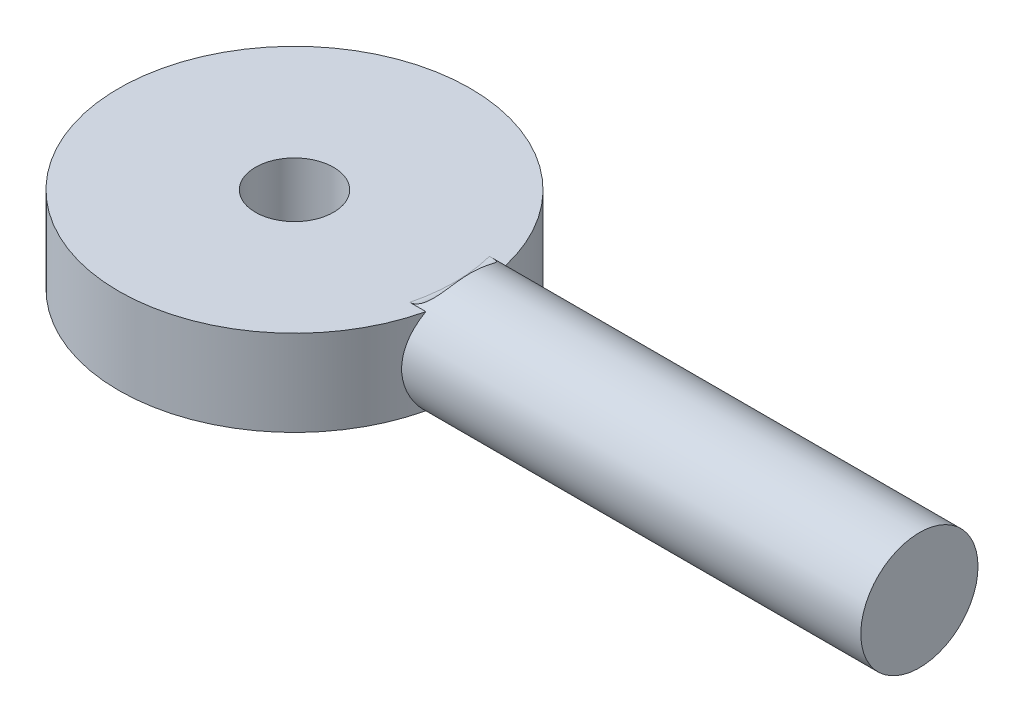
ISO-10303-21;
HEADER;
FILE_DESCRIPTION(('STEP AP214'),'2;1');
FILE_NAME('part.step','',(''),(''),'','','');
FILE_SCHEMA(('AUTOMOTIVE_DESIGN { 1 0 10303 214 1 1 1 1 }'));
ENDSEC;
DATA;
#1=APPLICATION_CONTEXT('core data for automotive mechanical design processes');
#2=APPLICATION_PROTOCOL_DEFINITION('international standard','automotive_design',2000,#1);
#3=PRODUCT_CONTEXT('',#1,'mechanical');
#4=PRODUCT('Part','Part','',(#3));
#5=PRODUCT_RELATED_PRODUCT_CATEGORY('part','',(#4));
#6=PRODUCT_DEFINITION_FORMATION('','',#4);
#7=PRODUCT_DEFINITION_CONTEXT('part definition',#1,'design');
#8=PRODUCT_DEFINITION('design','',#6,#7);
#9=PRODUCT_DEFINITION_SHAPE('','',#8);
#10=(LENGTH_UNIT() NAMED_UNIT(*) SI_UNIT(.MILLI.,.METRE.));
#11=(NAMED_UNIT(*) PLANE_ANGLE_UNIT() SI_UNIT($,.RADIAN.));
#12=(NAMED_UNIT(*) SI_UNIT($,.STERADIAN.) SOLID_ANGLE_UNIT());
#13=UNCERTAINTY_MEASURE_WITH_UNIT(LENGTH_MEASURE(1.E-05),#10,'distance_accuracy_value','');
#14=(GEOMETRIC_REPRESENTATION_CONTEXT(3) GLOBAL_UNCERTAINTY_ASSIGNED_CONTEXT((#13)) GLOBAL_UNIT_ASSIGNED_CONTEXT((#10,
#11,#12)) REPRESENTATION_CONTEXT('',''));
#15=CARTESIAN_POINT('',(0.,0.,0.));
#16=DIRECTION('',(0.,0.,1.));
#17=DIRECTION('',(1.,0.,0.));
#18=AXIS2_PLACEMENT_3D('',#15,#16,#17);
#19=CARTESIAN_POINT('',(-9.99200722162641E-13,3.49250000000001,-2.22044604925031E-13));
#20=DIRECTION('',(0.,-1.,0.));
#21=DIRECTION('',(0.,0.,-1.));
#22=AXIS2_PLACEMENT_3D('',#19,#20,#21);
#23=CYLINDRICAL_SURFACE('',#22,14.2875);
#24=CARTESIAN_POINT('',(-9.99200722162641E-13,3.49250000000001,-2.22044604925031E-13));
#25=DIRECTION('',(0.,1.,0.));
#26=DIRECTION('',(0.,0.,1.));
#27=AXIS2_PLACEMENT_3D('',#24,#25,#26);
#28=CIRCLE('',#27,14.2875);
#29=CARTESIAN_POINT('',(13.915775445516,3.49249999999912,-3.23787739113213));
#30=VERTEX_POINT('',#29);
#31=CARTESIAN_POINT('',(13.9157754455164,3.4924999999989,3.2378773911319));
#32=VERTEX_POINT('',#31);
#33=EDGE_CURVE('E105',#30,#32,#28,.T.);
#34=ORIENTED_EDGE('',*,*,#33,.F.);
#35=CARTESIAN_POINT('',(13.4703841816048,-8.88178419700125E-13,-4.76249999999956));
#36=CARTESIAN_POINT('',(13.470383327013,0.25940468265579,-4.76250122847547));
#37=CARTESIAN_POINT('',(13.4779592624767,0.518801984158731,-4.74123440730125));
#38=CARTESIAN_POINT('',(13.5072869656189,1.02991167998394,-4.65701601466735));
#39=CARTESIAN_POINT('',(13.529041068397,1.28162280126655,-4.59405757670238));
#40=CARTESIAN_POINT('',(13.5839932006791,1.76987307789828,-4.42891300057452));
#41=CARTESIAN_POINT('',(13.6171687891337,2.00644091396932,-4.32680374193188));
#42=CARTESIAN_POINT('',(13.691193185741,2.45916473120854,-4.08651850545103));
#43=CARTESIAN_POINT('',(13.7320436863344,2.67531619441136,-3.94833456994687));
#44=CARTESIAN_POINT('',(13.8186075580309,3.08952882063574,-3.63403108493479));
#45=CARTESIAN_POINT('',(13.8644421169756,3.28667472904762,-3.45673842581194));
#46=CARTESIAN_POINT('',(13.9547853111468,3.64905989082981,-3.07175376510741));
#47=CARTESIAN_POINT('',(13.9992937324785,3.81429402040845,-2.86405689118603));
#48=CARTESIAN_POINT('',(14.0833729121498,4.11231824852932,-2.41746646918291));
#49=CARTESIAN_POINT('',(14.1227845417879,4.24414936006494,-2.17790035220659));
#50=CARTESIAN_POINT('',(14.1908015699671,4.46527992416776,-1.67845369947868));
#51=CARTESIAN_POINT('',(14.2194098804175,4.55459083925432,-1.41857866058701));
#52=CARTESIAN_POINT('',(14.2617384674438,4.68504200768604,-0.89548724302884));
#53=CARTESIAN_POINT('',(14.2759421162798,4.72775016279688,-0.632701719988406));
#54=CARTESIAN_POINT('',(14.2895768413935,4.76876884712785,-0.103336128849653));
#55=CARTESIAN_POINT('',(14.2890117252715,4.76709081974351,0.163242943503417));
#56=CARTESIAN_POINT('',(14.2735001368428,4.72037923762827,0.681530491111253));
#57=CARTESIAN_POINT('',(14.2591185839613,4.67704870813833,0.933412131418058));
#58=CARTESIAN_POINT('',(14.2182993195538,4.55107842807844,1.42609937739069));
#59=CARTESIAN_POINT('',(14.1918607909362,4.4684360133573,1.66690423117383));
#60=CARTESIAN_POINT('',(14.129178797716,4.26519347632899,2.13432616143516));
#61=CARTESIAN_POINT('',(14.0928110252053,4.14410871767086,2.36071515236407));
#62=CARTESIAN_POINT('',(14.0140559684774,3.86781815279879,2.79046460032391));
#63=CARTESIAN_POINT('',(13.9716670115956,3.71260285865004,2.99381863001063));
#64=CARTESIAN_POINT('',(13.8829823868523,3.36387570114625,3.38185537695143));
#65=CARTESIAN_POINT('',(13.8365967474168,3.16890483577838,3.56520824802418));
#66=CARTESIAN_POINT('',(13.7468293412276,2.75058794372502,3.89704544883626));
#67=CARTESIAN_POINT('',(13.7034480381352,2.52723755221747,4.04552440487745));
#68=CARTESIAN_POINT('',(13.6241087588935,2.05428710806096,4.30524025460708));
#69=CARTESIAN_POINT('',(13.5882654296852,1.80435822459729,4.41591603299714));
#70=CARTESIAN_POINT('',(13.5293886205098,1.2879162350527,4.5931607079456));
#71=CARTESIAN_POINT('',(13.506349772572,1.02141013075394,4.65974808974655));
#72=CARTESIAN_POINT('',(13.4769051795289,0.492259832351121,4.74421810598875));
#73=CARTESIAN_POINT('',(13.4697959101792,0.229983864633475,4.76416256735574));
#74=CARTESIAN_POINT('',(13.4710490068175,-0.294208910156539,4.76062090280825));
#75=CARTESIAN_POINT('',(13.4794085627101,-0.556125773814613,4.73714266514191));
#76=CARTESIAN_POINT('',(13.5099560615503,-1.06278504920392,4.64927466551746));
#77=CARTESIAN_POINT('',(13.5316591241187,-1.30780836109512,4.58631795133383));
#78=CARTESIAN_POINT('',(13.5859148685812,-1.78376392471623,4.42299977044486));
#79=CARTESIAN_POINT('',(13.6184694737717,-2.0146936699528,4.32263167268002));
#80=CARTESIAN_POINT('',(13.6920387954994,-2.46402425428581,4.08372154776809));
#81=CARTESIAN_POINT('',(13.7332890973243,-2.68179538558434,3.94406970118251));
#82=CARTESIAN_POINT('',(13.8191447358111,-3.09155807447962,3.63181406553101));
#83=CARTESIAN_POINT('',(13.8637510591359,-3.28354200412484,3.45920056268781));
#84=CARTESIAN_POINT('',(13.953888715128,-3.64582702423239,3.0760592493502));
#85=CARTESIAN_POINT('',(13.9993613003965,-3.81464053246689,2.86410687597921));
#86=CARTESIAN_POINT('',(14.0839913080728,-4.11440062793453,2.41376497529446));
#87=CARTESIAN_POINT('',(14.1231489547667,-4.24534856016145,2.17537638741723));
#88=CARTESIAN_POINT('',(14.1905548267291,-4.4644632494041,1.68011409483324));
#89=CARTESIAN_POINT('',(14.2188738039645,-4.5529084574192,1.4233737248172));
#90=CARTESIAN_POINT('',(14.2617163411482,-4.68500337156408,0.89753344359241));
#91=CARTESIAN_POINT('',(14.2762448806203,-4.72866924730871,0.628438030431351));
#92=CARTESIAN_POINT('',(14.2894937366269,-4.76851064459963,0.0991330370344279));
#93=CARTESIAN_POINT('',(14.2889249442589,-4.76682174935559,-0.160899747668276));
#94=CARTESIAN_POINT('',(14.2737933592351,-4.7212695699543,-0.676804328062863));
#95=CARTESIAN_POINT('',(14.2592317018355,-4.677409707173,-0.932676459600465));
#96=CARTESIAN_POINT('',(14.2180110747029,-4.5501771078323,-1.4289505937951));
#97=CARTESIAN_POINT('',(14.1915479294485,-4.4674430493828,-1.66953376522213));
#98=CARTESIAN_POINT('',(14.1292497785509,-4.26540200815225,-2.1334968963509));
#99=CARTESIAN_POINT('',(14.0934130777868,-4.1460884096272,-2.35687373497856));
#100=CARTESIAN_POINT('',(14.0144120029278,-3.86920019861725,-2.78908200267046));
#101=CARTESIAN_POINT('',(13.9710258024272,-3.71037476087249,-2.99707102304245));
#102=CARTESIAN_POINT('',(13.8823535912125,-3.36109917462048,-3.38414213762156));
#103=CARTESIAN_POINT('',(13.8370669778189,-3.17063893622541,-3.56321497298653));
#104=CARTESIAN_POINT('',(13.7475887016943,-2.75458544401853,-3.89449536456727));
#105=CARTESIAN_POINT('',(13.7035092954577,-2.52790875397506,-4.04537687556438));
#106=CARTESIAN_POINT('',(13.6236167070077,-2.05104479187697,-4.30679705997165));
#107=CARTESIAN_POINT('',(13.5878013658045,-1.80086368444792,-4.41734627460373));
#108=CARTESIAN_POINT('',(13.5303260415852,-1.29558181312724,-4.59030623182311));
#109=CARTESIAN_POINT('',(13.5080993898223,-1.0412145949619,-4.65466704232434));
#110=CARTESIAN_POINT('',(13.4781313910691,-0.524560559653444,-4.74075594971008));
#111=CARTESIAN_POINT('',(13.4703850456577,-0.262276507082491,-4.7624987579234));
#112=CARTESIAN_POINT('',(13.4703841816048,-8.88178419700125E-13,-4.76249999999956));
#113=B_SPLINE_CURVE_WITH_KNOTS('',3,(#35,#36,#37,#38,#39,#40,#41,#42,#43,#44,#45,#46,#47,#48,
#49,#50,#51,#52,#53,#54,#55,#56,#57,#58,#59,#60,#61,#62,#63,#64,#65,#66,#67,#68,#69,#70,#71,#72,
#73,#74,#75,#76,#77,#78,#79,#80,#81,#82,#83,#84,#85,#86,#87,#88,#89,#90,#91,#92,#93,#94,#95,#96,
#97,#98,#99,#100,#101,#102,#103,#104,#105,#106,#107,#108,#109,#110,#111,#112),.UNSPECIFIED.,.T.,
.F.,(4,2,2,2,2,2,2,2,2,2,2,2,2,2,2,2,2,2,2,2,2,2,2,2,2,2,2,2,2,2,2,2,2,2,2,2,2,2,4),(0.,
0.777242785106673,1.55461361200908,2.33046568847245,3.10648905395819,3.91007619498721,
4.7137922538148,5.53847823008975,6.3629417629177,7.15871943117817,7.95429193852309,
8.71866135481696,9.483082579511,10.2575513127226,11.0322356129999,11.8433933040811,
12.654675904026,13.4775244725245,14.3000278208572,15.0854231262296,15.8706757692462,
16.6289543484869,17.3873673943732,18.1698355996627,18.9525347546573,19.7728907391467,
20.5932175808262,21.408094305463,22.2226766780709,22.9989737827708,23.7752079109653,
24.5391125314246,25.3031553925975,26.0954291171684,26.8879560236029,27.7115064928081,
28.5348415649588,29.3209604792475,30.1068079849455),.UNSPECIFIED.);
#114=CARTESIAN_POINT('',(13.9157754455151,-3.49250000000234,-3.23787739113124));
#115=VERTEX_POINT('',#114);
#116=EDGE_CURVE('E111',#115,#30,#113,.T.);
#117=ORIENTED_EDGE('',*,*,#116,.F.);
#118=CARTESIAN_POINT('',(-5.55111512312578E-13,-3.49250000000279,4.44089209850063E-13));
#119=DIRECTION('',(0.,1.,0.));
#120=DIRECTION('',(0.,0.,1.));
#121=AXIS2_PLACEMENT_3D('',#118,#119,#120);
#122=CIRCLE('',#121,14.2875);
#123=CARTESIAN_POINT('',(13.9157754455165,-3.49250000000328,3.23787739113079));
#124=VERTEX_POINT('',#123);
#125=EDGE_CURVE('E101',#115,#124,#122,.T.);
#126=ORIENTED_EDGE('',*,*,#125,.T.);
#127=EDGE_CURVE('E110',#32,#124,#113,.T.);
#128=ORIENTED_EDGE('',*,*,#127,.F.);
#129=EDGE_LOOP('',(#34,#117,#126,#128));
#130=FACE_BOUND('',#129,.T.);
#131=ADVANCED_FACE('F46',(#130),#23,.T.);
#132=CARTESIAN_POINT('',(-9.99200722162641E-13,3.49250000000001,-2.22044604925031E-13));
#133=DIRECTION('',(0.,1.,0.));
#134=DIRECTION('',(0.,0.,1.));
#135=AXIS2_PLACEMENT_3D('',#132,#133,#134);
#136=PLANE('',#135);
#137=CARTESIAN_POINT('',(-9.99200722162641E-13,3.49250000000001,-2.22044604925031E-13));
#138=DIRECTION('',(0.,1.,0.));
#139=DIRECTION('',(0.,0.,1.));
#140=AXIS2_PLACEMENT_3D('',#137,#138,#139);
#141=CIRCLE('',#140,3.175);
#142=CARTESIAN_POINT('',(-9.99211737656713E-13,3.49250000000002,3.17499999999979));
#143=VERTEX_POINT('',#142);
#144=EDGE_CURVE('E115',#143,#143,#141,.T.);
#145=ORIENTED_EDGE('',*,*,#144,.F.);
#146=EDGE_LOOP('',(#145));
#147=FACE_BOUND('',#146,.T.);
#148=CARTESIAN_POINT('',(-9.99200722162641E-13,3.49250000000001,-2.22044604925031E-13));
#149=DIRECTION('',(0.,1.,0.));
#150=DIRECTION('',(0.,0.,1.));
#151=AXIS2_PLACEMENT_3D('',#148,#149,#150);
#152=CIRCLE('',#151,13.0175);
#153=CARTESIAN_POINT('',(12.6083883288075,3.49249999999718,3.23787739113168));
#154=VERTEX_POINT('',#153);
#155=CARTESIAN_POINT('',(12.6083883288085,3.49249999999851,-3.23787739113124));
#156=VERTEX_POINT('',#155);
#157=EDGE_CURVE('E174',#154,#156,#152,.T.);
#158=ORIENTED_EDGE('',*,*,#157,.T.);
#159=DIRECTION('',(0.999999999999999,0.,0.));
#160=VECTOR('',#159,1.);
#161=CARTESIAN_POINT('',(12.6083883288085,3.49249999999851,-3.23787739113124));
#162=LINE('',#161,#160);
#163=EDGE_CURVE('E170',#156,#30,#162,.T.);
#164=ORIENTED_EDGE('',*,*,#163,.T.);
#165=ORIENTED_EDGE('',*,*,#33,.T.);
#166=DIRECTION('',(0.999999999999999,0.,0.));
#167=VECTOR('',#166,1.);
#168=CARTESIAN_POINT('',(13.9157754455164,3.4924999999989,3.2378773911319));
#169=LINE('',#168,#167);
#170=EDGE_CURVE('E65',#32,#154,#169,.F.);
#171=ORIENTED_EDGE('',*,*,#170,.T.);
#172=EDGE_LOOP('',(#158,#164,#165,#171));
#173=FACE_BOUND('',#172,.T.);
#174=ADVANCED_FACE('F142',(#147,#173),#136,.T.);
#175=CARTESIAN_POINT('',(-5.55111512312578E-13,-3.49250000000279,4.44089209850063E-13));
#176=DIRECTION('',(0.,1.,0.));
#177=DIRECTION('',(0.,0.,1.));
#178=AXIS2_PLACEMENT_3D('',#175,#176,#177);
#179=PLANE('',#178);
#180=CARTESIAN_POINT('',(-5.55111512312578E-13,-3.49250000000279,4.44089209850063E-13));
#181=DIRECTION('',(0.,1.,0.));
#182=DIRECTION('',(0.,0.,1.));
#183=AXIS2_PLACEMENT_3D('',#180,#181,#182);
#184=CIRCLE('',#183,3.175);
#185=CARTESIAN_POINT('',(-5.55122527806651E-13,-3.49250000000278,3.17500000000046));
#186=VERTEX_POINT('',#185);
#187=EDGE_CURVE('E112',#186,#186,#184,.T.);
#188=ORIENTED_EDGE('',*,*,#187,.T.);
#189=EDGE_LOOP('',(#188));
#190=FACE_BOUND('',#189,.T.);
#191=ORIENTED_EDGE('',*,*,#125,.F.);
#192=DIRECTION('',(0.999999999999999,0.,0.));
#193=VECTOR('',#192,1.);
#194=CARTESIAN_POINT('',(13.9157754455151,-3.49250000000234,-3.23787739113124));
#195=LINE('',#194,#193);
#196=CARTESIAN_POINT('',(12.6083883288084,-3.4925000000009,-3.23787739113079));
#197=VERTEX_POINT('',#196);
#198=EDGE_CURVE('E72',#115,#197,#195,.F.);
#199=ORIENTED_EDGE('',*,*,#198,.T.);
#200=CARTESIAN_POINT('',(-5.55111512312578E-13,-3.49250000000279,4.44089209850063E-13));
#201=DIRECTION('',(0.,1.,0.));
#202=DIRECTION('',(0.,0.,1.));
#203=AXIS2_PLACEMENT_3D('',#200,#201,#202);
#204=CIRCLE('',#203,13.0175);
#205=CARTESIAN_POINT('',(12.6083883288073,-3.49250000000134,3.23787739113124));
#206=VERTEX_POINT('',#205);
#207=EDGE_CURVE('E104',#197,#206,#204,.F.);
#208=ORIENTED_EDGE('',*,*,#207,.T.);
#209=DIRECTION('',(0.999999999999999,0.,0.));
#210=VECTOR('',#209,1.);
#211=CARTESIAN_POINT('',(12.6083883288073,-3.49250000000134,3.23787739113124));
#212=LINE('',#211,#210);
#213=EDGE_CURVE('E98',#206,#124,#212,.T.);
#214=ORIENTED_EDGE('',*,*,#213,.T.);
#215=EDGE_LOOP('',(#191,#199,#208,#214));
#216=FACE_BOUND('',#215,.T.);
#217=ADVANCED_FACE('F100',(#190,#216),#179,.F.);
#218=CARTESIAN_POINT('',(-9.99200722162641E-13,3.49250000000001,-2.22044604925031E-13));
#219=DIRECTION('',(0.,1.,0.));
#220=DIRECTION('',(0.,0.,1.));
#221=AXIS2_PLACEMENT_3D('',#218,#219,#220);
#222=CYLINDRICAL_SURFACE('',#221,3.175);
#223=ORIENTED_EDGE('',*,*,#187,.F.);
#224=EDGE_LOOP('',(#223));
#225=FACE_BOUND('',#224,.T.);
#226=ORIENTED_EDGE('',*,*,#144,.T.);
#227=EDGE_LOOP('',(#226));
#228=FACE_BOUND('',#227,.T.);
#229=ADVANCED_FACE('F131',(#225,#228),#222,.F.);
#230=CARTESIAN_POINT('',(50.7999999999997,-2.1094237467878E-12,0.));
#231=DIRECTION('',(0.999999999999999,0.,0.));
#232=DIRECTION('',(0.,0.,-1.));
#233=AXIS2_PLACEMENT_3D('',#230,#231,#232);
#234=PLANE('',#233);
#235=CARTESIAN_POINT('',(50.7999999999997,-2.1094237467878E-12,0.));
#236=DIRECTION('',(0.999999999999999,0.,0.));
#237=DIRECTION('',(0.,0.,-1.));
#238=AXIS2_PLACEMENT_3D('',#235,#236,#237);
#239=CIRCLE('',#238,4.7625);
#240=CARTESIAN_POINT('',(50.7999999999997,-2.119337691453E-12,-4.76250000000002));
#241=VERTEX_POINT('',#240);
#242=EDGE_CURVE('E119',#241,#241,#239,.T.);
#243=ORIENTED_EDGE('',*,*,#242,.T.);
#244=EDGE_LOOP('',(#243));
#245=FACE_BOUND('',#244,.T.);
#246=ADVANCED_FACE('F129',(#245),#234,.T.);
#247=CARTESIAN_POINT('',(-14.2884999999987,-2.1094237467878E-12,6.66133814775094E-13));
#248=DIRECTION('',(0.999999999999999,0.,0.));
#249=DIRECTION('',(0.,0.,-1.));
#250=AXIS2_PLACEMENT_3D('',#247,#248,#249);
#251=CYLINDRICAL_SURFACE('',#250,4.7625);
#252=ORIENTED_EDGE('',*,*,#242,.F.);
#253=EDGE_LOOP('',(#252));
#254=FACE_BOUND('',#253,.T.);
#255=CARTESIAN_POINT('',(12.6083883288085,3.49249999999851,-3.23787739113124));
#256=CARTESIAN_POINT('',(12.6727535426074,3.49246033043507,-3.23786772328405));
#257=CARTESIAN_POINT('',(12.7367878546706,3.49708107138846,-3.23294098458));
#258=CARTESIAN_POINT('',(12.8619858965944,3.51402638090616,-3.21453881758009));
#259=CARTESIAN_POINT('',(12.9231710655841,3.52627759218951,-3.20114477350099));
#260=CARTESIAN_POINT('',(13.0413907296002,3.55683393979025,-3.16714827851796));
#261=CARTESIAN_POINT('',(13.0984476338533,3.57510284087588,-3.14658893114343));
#262=CARTESIAN_POINT('',(13.208231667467,3.61629689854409,-3.09916121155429));
#263=CARTESIAN_POINT('',(13.2609461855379,3.63923498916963,-3.07227528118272));
#264=CARTESIAN_POINT('',(13.3869791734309,3.70088284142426,-2.99803418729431));
#265=CARTESIAN_POINT('',(13.4572257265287,3.74169993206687,-2.94720550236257));
#266=CARTESIAN_POINT('',(13.5865205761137,3.82704952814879,-2.8354977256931));
#267=CARTESIAN_POINT('',(13.645553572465,3.87158699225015,-2.77460511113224));
#268=CARTESIAN_POINT('',(13.7366421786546,3.9477289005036,-2.66455765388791));
#269=CARTESIAN_POINT('',(13.7714358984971,3.97913726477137,-2.61748295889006));
#270=CARTESIAN_POINT('',(13.8362885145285,4.0416094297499,-2.51995292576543));
#271=CARTESIAN_POINT('',(13.8663456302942,4.07267309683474,-2.46949632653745));
#272=CARTESIAN_POINT('',(13.9500463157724,4.16446005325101,-2.31368452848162));
#273=CARTESIAN_POINT('',(13.9971843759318,4.22374831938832,-2.20393123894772));
#274=CARTESIAN_POINT('',(14.0664020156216,4.31979779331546,-2.00731414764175));
#275=CARTESIAN_POINT('',(14.0918093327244,4.35828911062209,-1.92238538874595));
#276=CARTESIAN_POINT('',(14.1364747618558,4.43071940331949,-1.74898415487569));
#277=CARTESIAN_POINT('',(14.1557299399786,4.46465620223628,-1.66051001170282));
#278=CARTESIAN_POINT('',(14.1892280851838,4.52748819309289,-1.48066242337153));
#279=CARTESIAN_POINT('',(14.2034597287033,4.55637192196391,-1.38928292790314));
#280=CARTESIAN_POINT('',(14.2278423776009,4.6086829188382,-1.20443925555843));
#281=CARTESIAN_POINT('',(14.2379929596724,4.63210962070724,-1.11097486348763));
#282=CARTESIAN_POINT('',(14.254053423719,4.67094335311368,-0.933273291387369));
#283=CARTESIAN_POINT('',(14.2603149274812,4.6869603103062,-0.849199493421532));
#284=CARTESIAN_POINT('',(14.2707154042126,4.71445490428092,-0.680185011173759));
#285=CARTESIAN_POINT('',(14.2748544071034,4.72593260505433,-0.595244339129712));
#286=CARTESIAN_POINT('',(14.2813202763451,4.74422838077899,-0.425381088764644));
#287=CARTESIAN_POINT('',(14.2836592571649,4.75107756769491,-0.340462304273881));
#288=CARTESIAN_POINT('',(14.2867374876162,4.76021487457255,-0.170361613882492));
#289=CARTESIAN_POINT('',(14.287476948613,4.76250359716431,-0.0851797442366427));
#290=CARTESIAN_POINT('',(14.2875000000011,4.76250000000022,-4.44089209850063E-13));
#291=B_SPLINE_CURVE_WITH_KNOTS('',3,(#255,#256,#257,#258,#259,#260,#261,#262,#263,#264,#265,
#266,#267,#268,#269,#270,#271,#272,#273,#274,#275,#276,#277,#278,#279,#280,#281,#282,#283,#284,
#285,#286,#287,#288,#289,#290),.UNSPECIFIED.,.F.,.F.,(4,2,2,2,2,2,2,2,2,2,2,2,2,2,2,2,2,4),(0.,
0.19226762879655,0.382714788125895,0.572035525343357,0.7618880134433,1.04780993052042,
1.3341192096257,1.53315339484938,1.73226221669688,2.13066966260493,2.42026810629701,
2.71000445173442,3.0003897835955,3.29080522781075,3.54809839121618,3.8053879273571,
4.06093033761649,4.31643897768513),.UNSPECIFIED.);
#292=CARTESIAN_POINT('',(14.2875000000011,4.76250000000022,-4.44089209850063E-13));
#293=VERTEX_POINT('',#292);
#294=EDGE_CURVE('E59',#156,#293,#291,.T.);
#295=ORIENTED_EDGE('',*,*,#294,.T.);
#296=CARTESIAN_POINT('',(14.2875000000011,4.76250000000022,-4.44089209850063E-13));
#297=CARTESIAN_POINT('',(14.2874972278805,4.76250003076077,0.0534257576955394));
#298=CARTESIAN_POINT('',(14.2872006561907,4.76160087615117,0.106846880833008));
#299=CARTESIAN_POINT('',(14.2859965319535,4.75800650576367,0.213621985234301));
#300=CARTESIAN_POINT('',(14.2850889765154,4.75531128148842,0.266975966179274));
#301=CARTESIAN_POINT('',(14.2814134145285,4.74453101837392,0.426908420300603));
#302=CARTESIAN_POINT('',(14.2776924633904,4.73375139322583,0.533298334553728));
#303=CARTESIAN_POINT('',(14.2671954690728,4.70496676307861,0.745851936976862));
#304=CARTESIAN_POINT('',(14.2603939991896,4.68690176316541,0.852006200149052));
#305=CARTESIAN_POINT('',(14.2429302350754,4.64370334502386,1.06252594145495));
#306=CARTESIAN_POINT('',(14.2322692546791,4.61857233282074,1.1668920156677));
#307=CARTESIAN_POINT('',(14.2084861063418,4.5669211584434,1.35357294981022));
#308=CARTESIAN_POINT('',(14.1962129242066,4.54156628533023,1.43631936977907));
#309=CARTESIAN_POINT('',(14.1677057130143,4.48662588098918,1.59969301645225));
#310=CARTESIAN_POINT('',(14.151472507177,4.45704122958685,1.68032067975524));
#311=CARTESIAN_POINT('',(14.1142926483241,4.39407469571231,1.83868087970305));
#312=CARTESIAN_POINT('',(14.0933607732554,4.36070487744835,1.91642162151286));
#313=CARTESIAN_POINT('',(14.0458812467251,4.29061864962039,2.06857853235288));
#314=CARTESIAN_POINT('',(14.0193358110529,4.2539035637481,2.14299599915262));
#315=CARTESIAN_POINT('',(13.9480366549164,4.16296944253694,2.31602475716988));
#316=CARTESIAN_POINT('',(13.9002184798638,4.10750472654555,2.41276340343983));
#317=CARTESIAN_POINT('',(13.7893494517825,3.99438491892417,2.5957303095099));
#318=CARTESIAN_POINT('',(13.7263173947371,3.93673260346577,2.68197134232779));
#319=CARTESIAN_POINT('',(13.6013239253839,3.83827129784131,2.82034930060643));
#320=CARTESIAN_POINT('',(13.5432111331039,3.79692540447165,2.87556761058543));
#321=CARTESIAN_POINT('',(13.4169330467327,3.71816158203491,2.97670482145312));
#322=CARTESIAN_POINT('',(13.348773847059,3.68074129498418,3.02262932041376));
#323=CARTESIAN_POINT('',(13.2199029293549,3.62109846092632,3.09365246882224));
#324=CARTESIAN_POINT('',(13.1611920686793,3.5973697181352,3.1211094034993));
#325=CARTESIAN_POINT('',(13.038840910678,3.55598129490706,3.16818263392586));
#326=CARTESIAN_POINT('',(12.9752181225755,3.5383011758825,3.1878253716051));
#327=CARTESIAN_POINT('',(12.8611291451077,3.51438903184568,3.21414344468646));
#328=CARTESIAN_POINT('',(12.8115110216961,3.50637937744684,3.2228579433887));
#329=CARTESIAN_POINT('',(12.710781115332,3.4954102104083,3.23473968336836));
#330=CARTESIAN_POINT('',(12.6596621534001,3.49248130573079,3.23787330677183));
#331=CARTESIAN_POINT('',(12.6083883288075,3.49249999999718,3.23787739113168));
#332=B_SPLINE_CURVE_WITH_KNOTS('',3,(#296,#297,#298,#299,#300,#301,#302,#303,#304,#305,#306,
#307,#308,#309,#310,#311,#312,#313,#314,#315,#316,#317,#318,#319,#320,#321,#322,#323,#324,#325,
#326,#327,#328,#329,#330,#331),.UNSPECIFIED.,.F.,.F.,(4,2,2,2,2,2,2,2,2,2,2,2,2,2,2,2,2,4),(0.,
0.160259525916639,0.320519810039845,0.641217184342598,0.964611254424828,1.28789533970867,
1.54992940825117,1.81190905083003,2.07307599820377,2.3341400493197,2.69693681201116,
3.05928763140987,3.32897149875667,3.59849243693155,3.80481950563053,4.01044233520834,
4.16293637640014,4.31634593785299),.UNSPECIFIED.);
#333=EDGE_CURVE('E13',#293,#154,#332,.T.);
#334=ORIENTED_EDGE('',*,*,#333,.T.);
#335=ORIENTED_EDGE('',*,*,#170,.F.);
#336=ORIENTED_EDGE('',*,*,#127,.T.);
#337=ORIENTED_EDGE('',*,*,#213,.F.);
#338=CARTESIAN_POINT('',(12.6083883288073,-3.49250000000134,3.23787739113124));
#339=CARTESIAN_POINT('',(12.6727535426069,-3.4924603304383,3.23786772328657));
#340=CARTESIAN_POINT('',(12.7367878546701,-3.49708107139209,3.23294098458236));
#341=CARTESIAN_POINT('',(12.8619858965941,-3.51402638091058,3.21453881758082));
#342=CARTESIAN_POINT('',(12.9231710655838,-3.52627759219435,3.20114477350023));
#343=CARTESIAN_POINT('',(13.0413907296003,-3.55683393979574,3.16714827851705));
#344=CARTESIAN_POINT('',(13.0984476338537,-3.57510284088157,3.14658893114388));
#345=CARTESIAN_POINT('',(13.208231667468,-3.61629689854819,3.09916121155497));
#346=CARTESIAN_POINT('',(13.2609461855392,-3.63923498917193,3.07227528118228));
#347=CARTESIAN_POINT('',(13.3869791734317,-3.70088284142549,2.9980341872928));
#348=CARTESIAN_POINT('',(13.4572257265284,-3.74169993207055,2.947205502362));
#349=CARTESIAN_POINT('',(13.5865205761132,-3.82704952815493,2.83549772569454));
#350=CARTESIAN_POINT('',(13.6455535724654,-3.87158699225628,2.77460511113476));
#351=CARTESIAN_POINT('',(13.7366421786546,-3.94772890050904,2.66455765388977));
#352=CARTESIAN_POINT('',(13.7714358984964,-3.97913726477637,2.61748295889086));
#353=CARTESIAN_POINT('',(13.8362885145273,-4.04160942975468,2.51995292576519));
#354=CARTESIAN_POINT('',(13.8663456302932,-4.07267309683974,2.46949632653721));
#355=CARTESIAN_POINT('',(13.9500463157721,-4.16446005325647,2.31368452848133));
#356=CARTESIAN_POINT('',(13.9971843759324,-4.22374831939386,2.20393123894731));
#357=CARTESIAN_POINT('',(14.0664020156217,-4.31979779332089,2.00731414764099));
#358=CARTESIAN_POINT('',(14.0918093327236,-4.35828911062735,1.92238538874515));
#359=CARTESIAN_POINT('',(14.1364747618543,-4.43071940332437,1.74898415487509));
#360=CARTESIAN_POINT('',(14.1557299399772,-4.46465620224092,1.66051001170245));
#361=CARTESIAN_POINT('',(14.1892280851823,-4.52748819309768,1.48066242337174));
#362=CARTESIAN_POINT('',(14.2034597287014,-4.5563719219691,1.38928292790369));
#363=CARTESIAN_POINT('',(14.2278423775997,-4.60868291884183,1.20443925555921));
#364=CARTESIAN_POINT('',(14.2379929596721,-4.63210962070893,1.11097486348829));
#365=CARTESIAN_POINT('',(14.2540534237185,-4.67094335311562,0.933273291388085));
#366=CARTESIAN_POINT('',(14.26031492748,-4.68696031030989,0.849199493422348));
#367=CARTESIAN_POINT('',(14.2707154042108,-4.71445490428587,0.680185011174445));
#368=CARTESIAN_POINT('',(14.2748544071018,-4.72593260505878,0.595244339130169));
#369=CARTESIAN_POINT('',(14.2813202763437,-4.74422838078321,0.42538108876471));
#370=CARTESIAN_POINT('',(14.2836592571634,-4.7510775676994,0.340462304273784));
#371=CARTESIAN_POINT('',(14.2867374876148,-4.76021487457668,0.170361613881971));
#372=CARTESIAN_POINT('',(14.2874769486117,-4.76250359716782,0.0851797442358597));
#373=CARTESIAN_POINT('',(14.2875000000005,-4.76250000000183,-6.66133814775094E-13));
#374=B_SPLINE_CURVE_WITH_KNOTS('',3,(#338,#339,#340,#341,#342,#343,#344,#345,#346,#347,#348,
#349,#350,#351,#352,#353,#354,#355,#356,#357,#358,#359,#360,#361,#362,#363,#364,#365,#366,#367,
#368,#369,#370,#371,#372,#373),.UNSPECIFIED.,.F.,.F.,(4,2,2,2,2,2,2,2,2,2,2,2,2,2,2,2,2,4),(0.,
0.192267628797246,0.382714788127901,0.572035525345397,0.761888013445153,1.04780993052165,
1.33411920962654,1.53315339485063,1.73226221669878,2.13066966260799,2.42026810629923,
2.71000445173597,3.00038978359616,3.29080522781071,3.54809839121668,3.80538792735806,
4.060930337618,4.31643897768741),.UNSPECIFIED.);
#375=CARTESIAN_POINT('',(14.2875000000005,-4.76250000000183,-6.66133814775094E-13));
#376=VERTEX_POINT('',#375);
#377=EDGE_CURVE('E161',#206,#376,#374,.T.);
#378=ORIENTED_EDGE('',*,*,#377,.T.);
#379=CARTESIAN_POINT('',(14.2875000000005,-4.76250000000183,-6.66133814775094E-13));
#380=CARTESIAN_POINT('',(14.2874972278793,-4.76250003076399,-0.0534257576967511));
#381=CARTESIAN_POINT('',(14.2872006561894,-4.76160087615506,-0.106846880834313));
#382=CARTESIAN_POINT('',(14.285996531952,-4.75800650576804,-0.213621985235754));
#383=CARTESIAN_POINT('',(14.2850889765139,-4.7553112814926,-0.26697596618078));
#384=CARTESIAN_POINT('',(14.2814134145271,-4.74453101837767,-0.426908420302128));
#385=CARTESIAN_POINT('',(14.277692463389,-4.7337513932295,-0.5332983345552));
#386=CARTESIAN_POINT('',(14.2671954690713,-4.70496676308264,-0.745851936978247));
#387=CARTESIAN_POINT('',(14.2603939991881,-4.68690176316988,-0.852006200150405));
#388=CARTESIAN_POINT('',(14.2429302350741,-4.64370334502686,-1.06252594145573));
#389=CARTESIAN_POINT('',(14.2322692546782,-4.61857233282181,-1.16689201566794));
#390=CARTESIAN_POINT('',(14.2084861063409,-4.5669211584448,-1.35357294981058));
#391=CARTESIAN_POINT('',(14.1962129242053,-4.54156628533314,-1.43631936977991));
#392=CARTESIAN_POINT('',(14.1677057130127,-4.48662588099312,-1.59969301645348));
#393=CARTESIAN_POINT('',(14.1514725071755,-4.45704122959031,-1.68032067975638));
#394=CARTESIAN_POINT('',(14.1142926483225,-4.39407469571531,-1.83868087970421));
#395=CARTESIAN_POINT('',(14.0933607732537,-4.36070487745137,-1.91642162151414));
#396=CARTESIAN_POINT('',(14.0458812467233,-4.29061864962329,-2.06857853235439));
#397=CARTESIAN_POINT('',(14.0193358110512,-4.25390356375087,-2.14299599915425));
#398=CARTESIAN_POINT('',(13.9480366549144,-4.16296944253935,-2.31602475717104));
#399=CARTESIAN_POINT('',(13.9002184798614,-4.10750472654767,-2.41276340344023));
#400=CARTESIAN_POINT('',(13.7893494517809,-3.99438491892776,-2.59573030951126));
#401=CARTESIAN_POINT('',(13.7263173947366,-3.9367326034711,-2.68197134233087));
#402=CARTESIAN_POINT('',(13.6013239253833,-3.83827129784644,-2.82034930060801));
#403=CARTESIAN_POINT('',(13.5432111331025,-3.79692540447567,-2.87556761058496));
#404=CARTESIAN_POINT('',(13.4169330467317,-3.71816158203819,-2.97670482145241));
#405=CARTESIAN_POINT('',(13.348773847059,-3.68074129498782,-3.02262932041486));
#406=CARTESIAN_POINT('',(13.2199029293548,-3.62109846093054,-3.09365246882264));
#407=CARTESIAN_POINT('',(13.1611920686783,-3.59736971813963,-3.12110940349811));
#408=CARTESIAN_POINT('',(13.0388409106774,-3.55598129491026,-3.16818263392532));
#409=CARTESIAN_POINT('',(12.975218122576,-3.53830117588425,-3.18782537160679));
#410=CARTESIAN_POINT('',(12.8611291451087,-3.51438903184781,-3.21414344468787));
#411=CARTESIAN_POINT('',(12.8115110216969,-3.50637937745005,-3.22285794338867));
#412=CARTESIAN_POINT('',(12.7107811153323,-3.49541021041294,-3.23473968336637));
#413=CARTESIAN_POINT('',(12.6596621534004,-3.49248130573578,-3.2378733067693));
#414=CARTESIAN_POINT('',(12.6083883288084,-3.4925000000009,-3.23787739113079));
#415=B_SPLINE_CURVE_WITH_KNOTS('',3,(#379,#380,#381,#382,#383,#384,#385,#386,#387,#388,#389,
#390,#391,#392,#393,#394,#395,#396,#397,#398,#399,#400,#401,#402,#403,#404,#405,#406,#407,#408,
#409,#410,#411,#412,#413,#414),.UNSPECIFIED.,.F.,.F.,(4,2,2,2,2,2,2,2,2,2,2,2,2,2,2,2,2,4),(0.,
0.160259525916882,0.320519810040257,0.641217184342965,0.964611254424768,1.28789533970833,
1.54992940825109,1.81190905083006,2.07307599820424,2.33414004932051,2.69693681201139,
3.05928763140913,3.32897149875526,3.59849243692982,3.80481950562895,4.01044233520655,
4.16293637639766,4.31634593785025),.UNSPECIFIED.);
#416=EDGE_CURVE('E155',#376,#197,#415,.T.);
#417=ORIENTED_EDGE('',*,*,#416,.T.);
#418=ORIENTED_EDGE('',*,*,#198,.F.);
#419=ORIENTED_EDGE('',*,*,#116,.T.);
#420=ORIENTED_EDGE('',*,*,#163,.F.);
#421=EDGE_LOOP('',(#295,#334,#335,#336,#337,#378,#417,#418,#419,#420));
#422=FACE_BOUND('',#421,.T.);
#423=ADVANCED_FACE('F114',(#254,#422),#251,.T.);
#424=CARTESIAN_POINT('',(-4.44089209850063E-13,-4.76250000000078,-8.88178419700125E-13));
#425=DIRECTION('',(0.,1.,0.));
#426=DIRECTION('',(0.,0.,1.));
#427=AXIS2_PLACEMENT_3D('',#424,#425,#426);
#428=TOROIDAL_SURFACE('',#427,13.0175,1.27);
#429=ORIENTED_EDGE('',*,*,#377,.F.);
#430=ORIENTED_EDGE('',*,*,#207,.F.);
#431=ORIENTED_EDGE('',*,*,#416,.F.);
#432=EDGE_LOOP('',(#429,#430,#431));
#433=FACE_BOUND('',#432,.T.);
#434=ADVANCED_FACE('F137',(#433),#428,.F.);
#435=CARTESIAN_POINT('',(9.99200722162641E-13,4.76249999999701,-6.66133814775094E-13));
#436=DIRECTION('',(0.,1.,0.));
#437=DIRECTION('',(0.,0.,1.));
#438=AXIS2_PLACEMENT_3D('',#435,#436,#437);
#439=TOROIDAL_SURFACE('',#438,13.0175,1.27);
#440=ORIENTED_EDGE('',*,*,#157,.F.);
#441=ORIENTED_EDGE('',*,*,#333,.F.);
#442=ORIENTED_EDGE('',*,*,#294,.F.);
#443=EDGE_LOOP('',(#440,#441,#442));
#444=FACE_BOUND('',#443,.T.);
#445=ADVANCED_FACE('F48',(#444),#439,.F.);
#446=CLOSED_SHELL('',(#131,#174,#217,#229,#246,#423,#434,#445));
#447=MANIFOLD_SOLID_BREP('B2',#446);
#448=ADVANCED_BREP_SHAPE_REPRESENTATION('',(#18,#447),#14);
#449=SHAPE_DEFINITION_REPRESENTATION(#9,#448);
ENDSEC;
END-ISO-10303-21;
